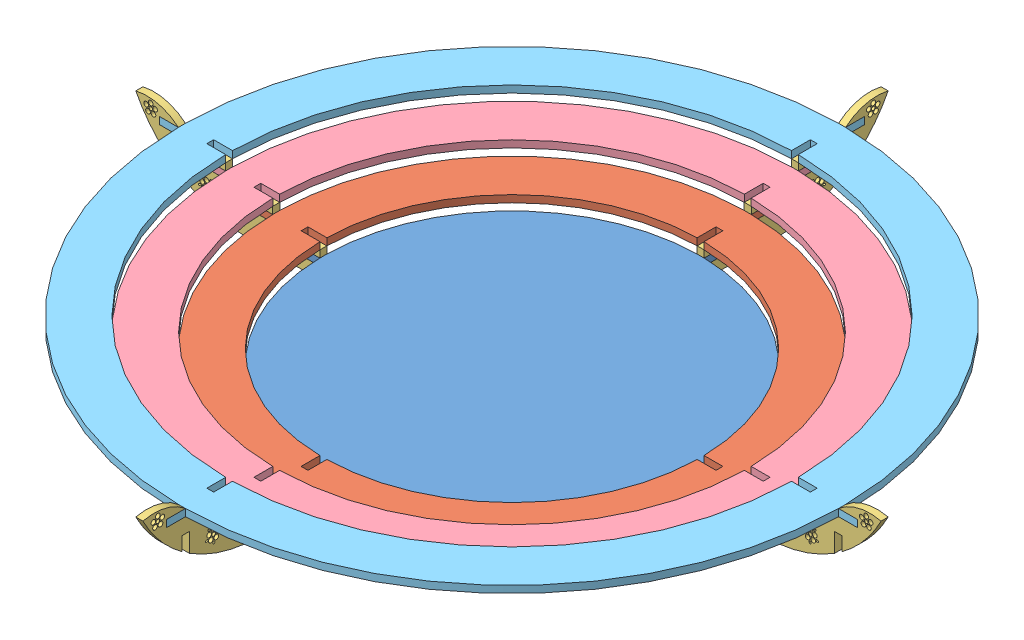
SolidWorks assembly Assem1.SLDASM, configuration Default (file format 7000). Lengths in mm.
Overall size (316.08 30.95 316.08).
8 component instances, 5 part files, 21 mates.
Components (placement in the parent):
- Part1-1: Part1.SLDPRT [Default] at (176.7237 31.8885 114.2603) size (175.97 3 175.97)
- Part2-1: Part2.SLDPRT [Default] at (176.7265 37.8885 114.2603) size (215.98 3 215.98)
- Part3-1: Part3.SLDPRT [Default] at (178.2237 51.4268 267.6452) x (0 0 1) z (-1 0 0) size (143.05 30.95 3)
- Part4-1: Part4.SLDPRT [Default] at (176.7284 43.8885 114.2603) size (255.98 3 255.98)
- Part5-1: Part5.SLDPRT [Default] at (176.7297 49.8885 114.2603) size (295.98 3 295.98)
- Part3-2: Part3.SLDPRT [Default] at (23.3388 51.4268 115.7603) x (-1 0 0) z (0 0 -1) size (143.05 30.95 3)
- Part3-3: Part3.SLDPRT [Default] at (175.2237 51.4268 -39.1245) x (0 0 -1) z (1 0 0) size (143.05 30.95 3)
- Part3-4: Part3.SLDPRT [Default] at (330.1085 51.4268 112.7603) size (143.05 30.95 3)
Mates (geometry in assembly coordinates):
- Coincident2: coincident aligned: plane of Part1-1 through (176.7237 34.8885 115.7603) normal (0 0 1); plane of Part3-4 through (285.1193 82.6214 115.7603) normal (0 0 1)
- Coincident5: coincident aligned: plane of Part1-1 through (178.2237 34.8885 114.2603) normal (1 0 0); plane of Part3-3 through (178.2237 82.6214 5.8647) normal (1 0 0)
- Coincident8: coincident anti-aligned: plane of Part1-1 through (176.7237 34.8885 202.2463) normal (0 0 1); plane of Part3-1 through (175.2237 34.8885 202.2463) normal (0 0 -1)
- Coincident9: coincident anti-aligned: plane of Part1-1 through (176.7237 31.8885 114.2603) normal (0 -1 0); plane of Part3-1 through (175.2237 31.8885 129.2463) normal (0 1 0)
- Coincident10: coincident aligned: plane of Part1-1 through (175.2237 34.8885 114.2603) normal (-1 0 0); plane of Part3-1 through (175.2237 82.6214 222.656) normal (-1 0 0)
- Coincident11: coincident anti-aligned: plane of Part1-1 through (176.7237 31.8885 114.2603) normal (0 -1 0); plane of Part3-4 through (191.7096 31.8885 115.7603) normal (0 1 0)
- Coincident12: coincident anti-aligned: plane of Part1-1 through (264.7096 34.8885 114.2603) normal (1 0 0); plane of Part3-4 through (264.7096 34.8885 115.7603) normal (-1 0 0)
- Coincident13: coincident anti-aligned: plane of Part1-1 through (176.7237 31.8885 114.2603) normal (0 -1 0); plane of Part3-3 through (178.2237 31.8885 99.2744) normal (0 1 0)
- Coincident14: coincident anti-aligned: plane of Part1-1 through (176.7237 34.8885 26.2744) normal (0 0 -1); plane of Part3-3 through (178.2237 34.8885 26.2744) normal (0 0 1)
- Coincident15: coincident anti-aligned: plane of Part1-1 through (176.7237 31.8885 114.2603) normal (0 -1 0); plane of Part3-2 through (161.7377 31.8885 112.7603) normal (0 1 0)
- Coincident16: coincident aligned: plane of Part1-1 through (176.7237 34.8885 112.7603) normal (0 0 -1); plane of Part3-2 through (68.328 82.6214 112.7603) normal (0 0 -1)
- Coincident17: coincident anti-aligned: plane of Part1-1 through (88.7377 34.8885 114.2603) normal (-1 0 0); plane of Part3-2 through (88.7377 34.8885 112.7603) normal (1 0 0)
- Coincident18: coincident aligned: plane of Part2-1 through (176.7265 40.8885 112.7603) normal (0 0 -1); plane of Part3-2 through (68.328 82.6214 112.7603) normal (0 0 -1)
- Coincident19: coincident: plane of Part2-1 through (176.7265 37.8885 114.2603) normal (0 -1 0); line of Part3-2 through (68.7377 37.8885 112.7603) axis (1 0 0)
- Coincident20: coincident anti-aligned: plane of Part2-1 through (68.7377 40.8885 114.2603) normal (-1 0 0); plane of Part3-2 through (68.7377 40.8885 112.7603) normal (1 0 0)
- Coincident21: coincident aligned: plane of Part4-1 through (176.7284 46.8885 112.7603) normal (0 0 -1); plane of Part3-2 through (68.328 82.6214 112.7603) normal (0 0 -1)
- Coincident22: coincident anti-aligned: plane of Part4-1 through (176.7284 43.8885 114.2603) normal (0 -1 0); plane of Part3-2 through (76.7377 43.8885 112.7603) normal (0 1 0)
- Coincident23: coincident anti-aligned: plane of Part4-1 through (48.7377 46.8885 114.2603) normal (-1 0 0); plane of Part3-2 through (48.7377 46.8885 112.7603) normal (1 0 0)
- Coincident24: coincident anti-aligned: plane of Part5-1 through (176.7297 49.8885 114.2603) normal (0 -1 0); plane of Part3-2 through (56.7377 49.8885 112.7603) normal (0 1 0)
- Coincident25: coincident aligned: plane of Part5-1 through (176.7297 52.8885 112.7603) normal (0 0 -1); plane of Part3-2 through (68.328 82.6214 112.7603) normal (0 0 -1)
- Coincident26: coincident anti-aligned: plane of Part5-1 through (28.7377 52.8885 114.2603) normal (-1 0 0); plane of Part3-2 through (28.7377 52.8885 112.7603) normal (1 0 0)
